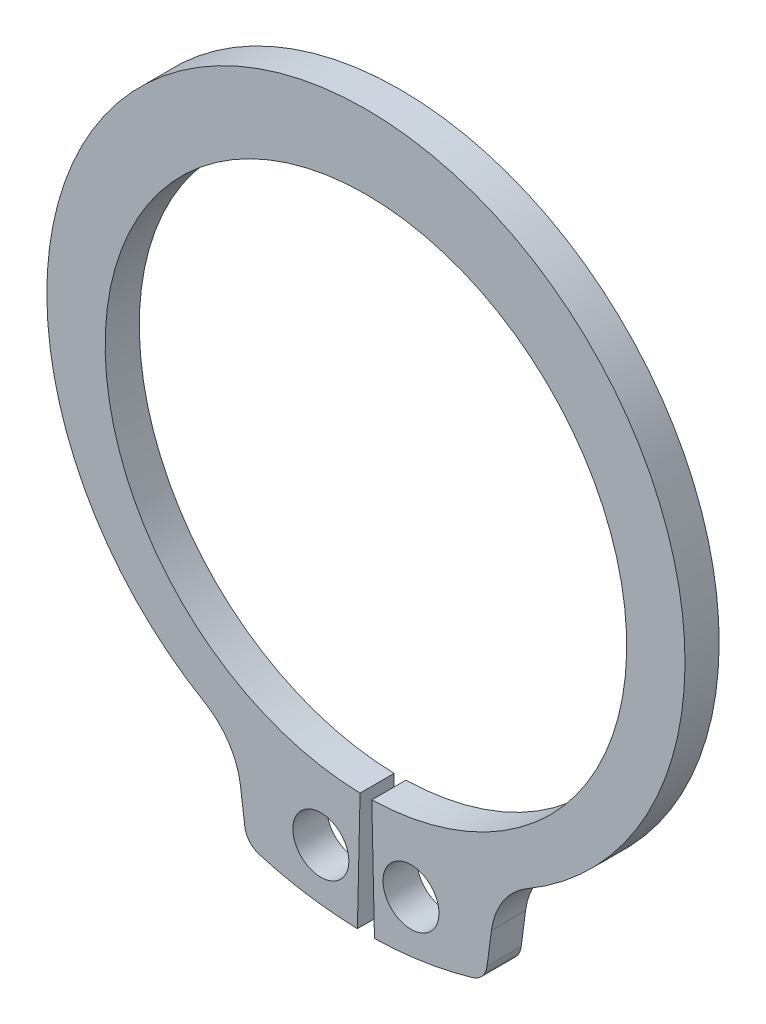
from build123d import *

# Parameters (mm, degrees)
BODYSKE_R  = 0.5207
BODY_DEPTH = 0.635


with BuildPart() as part:
    # BodySke → Body (new body)
    with BuildSketch(Plane.XY):
        with BuildLine():
            Line((0.109069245, -4.850173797), (0.15875, -7.059415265))
            ThreePointArc((0.15875, -7.059415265), (1.079672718, -6.978169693), (1.982087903, -6.777305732))
            ThreePointArc((1.982087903, -6.777305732), (2.164427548, -6.659563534), (2.252881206, -6.461354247))
            Line((2.252881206, -6.461354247), (2.334858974, -5.838671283))
            ThreePointArc((2.334858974, -5.838671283), (2.551773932, -5.259511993), (3.001107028, -4.834568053))
            ThreePointArc((3.001107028, -4.834568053), (0, 6.223), (-3.001107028, -4.834568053))
            ThreePointArc((-3.001107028, -4.834568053), (-2.551773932, -5.259511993), (-2.334858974, -5.838671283))
            Line((-2.334858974, -5.838671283), (-2.252881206, -6.461354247))
            ThreePointArc((-2.252881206, -6.461354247), (-2.164427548, -6.659563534), (-1.982087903, -6.777305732))
            ThreePointArc((-1.982087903, -6.777305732), (-1.079672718, -6.978169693), (-0.15875, -7.059415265))
            Line((-0.15875, -7.059415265), (-0.109069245, -4.850173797))
            ThreePointArc((-0.109069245, -4.850173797), (0, 4.8514), (0.109069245, -4.850173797))
        make_face()
        with Locations((0.8382, -6.050920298)):
            Circle(BODYSKE_R, mode=Mode.SUBTRACT)
        with Locations((-0.8382, -6.050920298)):
            Circle(BODYSKE_R, mode=Mode.SUBTRACT)
    extrude(amount=-BODY_DEPTH)


solid = part.part
